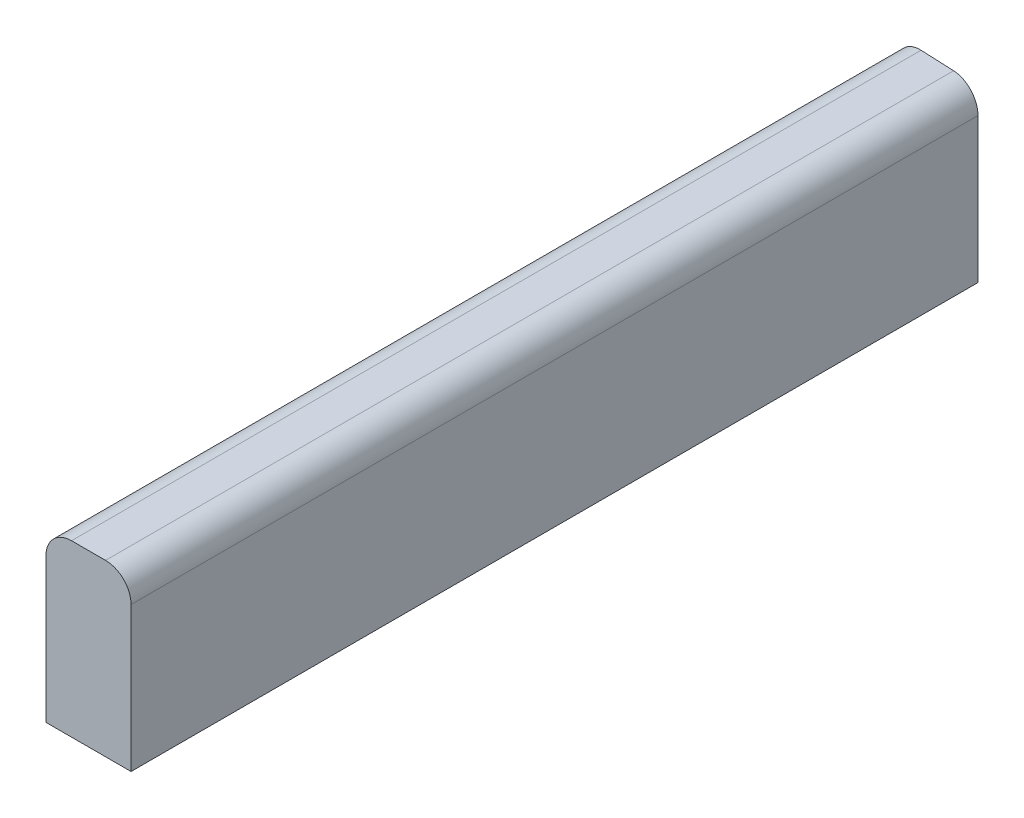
ISO-10303-21;
HEADER;
FILE_DESCRIPTION(('STEP AP214'),'2;1');
FILE_NAME('part.step','',(''),(''),'','','');
FILE_SCHEMA(('AUTOMOTIVE_DESIGN { 1 0 10303 214 1 1 1 1 }'));
ENDSEC;
DATA;
#1=APPLICATION_CONTEXT('core data for automotive mechanical design processes');
#2=APPLICATION_PROTOCOL_DEFINITION('international standard','automotive_design',2000,#1);
#3=PRODUCT_CONTEXT('',#1,'mechanical');
#4=PRODUCT('Part','Part','',(#3));
#5=PRODUCT_RELATED_PRODUCT_CATEGORY('part','',(#4));
#6=PRODUCT_DEFINITION_FORMATION('','',#4);
#7=PRODUCT_DEFINITION_CONTEXT('part definition',#1,'design');
#8=PRODUCT_DEFINITION('design','',#6,#7);
#9=PRODUCT_DEFINITION_SHAPE('','',#8);
#10=(LENGTH_UNIT() NAMED_UNIT(*) SI_UNIT(.MILLI.,.METRE.));
#11=(NAMED_UNIT(*) PLANE_ANGLE_UNIT() SI_UNIT($,.RADIAN.));
#12=(NAMED_UNIT(*) SI_UNIT($,.STERADIAN.) SOLID_ANGLE_UNIT());
#13=UNCERTAINTY_MEASURE_WITH_UNIT(LENGTH_MEASURE(1.E-05),#10,'distance_accuracy_value','');
#14=(GEOMETRIC_REPRESENTATION_CONTEXT(3) GLOBAL_UNCERTAINTY_ASSIGNED_CONTEXT((#13)) GLOBAL_UNIT_ASSIGNED_CONTEXT((#10,
#11,#12)) REPRESENTATION_CONTEXT('',''));
#15=CARTESIAN_POINT('',(0.,0.,0.));
#16=DIRECTION('',(0.,0.,1.));
#17=DIRECTION('',(1.,0.,0.));
#18=AXIS2_PLACEMENT_3D('',#15,#16,#17);
#19=CARTESIAN_POINT('',(0.,0.,100.));
#20=DIRECTION('',(1.,0.,0.));
#21=DIRECTION('',(0.,0.,-1.));
#22=AXIS2_PLACEMENT_3D('',#19,#20,#21);
#23=PLANE('',#22);
#24=DIRECTION('',(0.,-1.,0.));
#25=VECTOR('',#24,1.);
#26=CARTESIAN_POINT('',(0.,0.,0.));
#27=LINE('',#26,#25);
#28=CARTESIAN_POINT('',(0.,17.,0.));
#29=VERTEX_POINT('',#28);
#30=CARTESIAN_POINT('',(0.,0.,0.));
#31=VERTEX_POINT('',#30);
#32=EDGE_CURVE('E115',#29,#31,#27,.T.);
#33=ORIENTED_EDGE('',*,*,#32,.T.);
#34=DIRECTION('',(0.,0.,-1.));
#35=VECTOR('',#34,1.);
#36=CARTESIAN_POINT('',(0.,0.,100.));
#37=LINE('',#36,#35);
#38=CARTESIAN_POINT('',(0.,0.,100.));
#39=VERTEX_POINT('',#38);
#40=EDGE_CURVE('E11',#39,#31,#37,.T.);
#41=ORIENTED_EDGE('',*,*,#40,.F.);
#42=DIRECTION('',(0.,-1.,0.));
#43=VECTOR('',#42,1.);
#44=CARTESIAN_POINT('',(0.,0.,100.));
#45=LINE('',#44,#43);
#46=CARTESIAN_POINT('',(0.,17.,100.));
#47=VERTEX_POINT('',#46);
#48=EDGE_CURVE('E117',#47,#39,#45,.T.);
#49=ORIENTED_EDGE('',*,*,#48,.F.);
#50=DIRECTION('',(0.,0.,-1.));
#51=VECTOR('',#50,1.);
#52=CARTESIAN_POINT('',(0.,17.,100.));
#53=LINE('',#52,#51);
#54=EDGE_CURVE('E112',#47,#29,#53,.T.);
#55=ORIENTED_EDGE('',*,*,#54,.T.);
#56=EDGE_LOOP('',(#33,#41,#49,#55));
#57=FACE_BOUND('',#56,.T.);
#58=ADVANCED_FACE('F33',(#57),#23,.F.);
#59=CARTESIAN_POINT('',(0.,0.,100.));
#60=DIRECTION('',(0.,1.,0.));
#61=DIRECTION('',(0.,0.,1.));
#62=AXIS2_PLACEMENT_3D('',#59,#60,#61);
#63=PLANE('',#62);
#64=ORIENTED_EDGE('',*,*,#40,.T.);
#65=DIRECTION('',(0.999048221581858,0.,0.0436193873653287));
#66=VECTOR('',#65,1.);
#67=CARTESIAN_POINT('',(0.,0.,0.));
#68=LINE('',#67,#66);
#69=CARTESIAN_POINT('',(10.,0.,0.436609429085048));
#70=VERTEX_POINT('',#69);
#71=EDGE_CURVE('E84',#31,#70,#68,.T.);
#72=ORIENTED_EDGE('',*,*,#71,.T.);
#73=DIRECTION('',(0.,0.,-1.));
#74=VECTOR('',#73,1.);
#75=CARTESIAN_POINT('',(10.,0.,100.));
#76=LINE('',#75,#74);
#77=CARTESIAN_POINT('',(10.,0.,100.));
#78=VERTEX_POINT('',#77);
#79=EDGE_CURVE('E41',#78,#70,#76,.T.);
#80=ORIENTED_EDGE('',*,*,#79,.F.);
#81=DIRECTION('',(1.,0.,0.));
#82=VECTOR('',#81,1.);
#83=CARTESIAN_POINT('',(0.,0.,100.));
#84=LINE('',#83,#82);
#85=EDGE_CURVE('E124',#39,#78,#84,.T.);
#86=ORIENTED_EDGE('',*,*,#85,.F.);
#87=EDGE_LOOP('',(#64,#72,#80,#86));
#88=FACE_BOUND('',#87,.T.);
#89=ADVANCED_FACE('F95',(#88),#63,.F.);
#90=CARTESIAN_POINT('',(10.,0.,100.));
#91=DIRECTION('',(-1.,0.,0.));
#92=DIRECTION('',(0.,0.,1.));
#93=AXIS2_PLACEMENT_3D('',#90,#91,#92);
#94=PLANE('',#93);
#95=ORIENTED_EDGE('',*,*,#79,.T.);
#96=DIRECTION('',(0.,1.,0.));
#97=VECTOR('',#96,1.);
#98=CARTESIAN_POINT('',(10.,0.,0.436609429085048));
#99=LINE('',#98,#97);
#100=CARTESIAN_POINT('',(10.,17.,0.436609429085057));
#101=VERTEX_POINT('',#100);
#102=EDGE_CURVE('E81',#70,#101,#99,.T.);
#103=ORIENTED_EDGE('',*,*,#102,.T.);
#104=DIRECTION('',(0.,0.,-1.));
#105=VECTOR('',#104,1.);
#106=CARTESIAN_POINT('',(10.,17.,100.));
#107=LINE('',#106,#105);
#108=CARTESIAN_POINT('',(10.,17.,100.));
#109=VERTEX_POINT('',#108);
#110=EDGE_CURVE('E103',#109,#101,#107,.T.);
#111=ORIENTED_EDGE('',*,*,#110,.F.);
#112=DIRECTION('',(0.,1.,0.));
#113=VECTOR('',#112,1.);
#114=CARTESIAN_POINT('',(10.,0.,100.));
#115=LINE('',#114,#113);
#116=EDGE_CURVE('E102',#78,#109,#115,.T.);
#117=ORIENTED_EDGE('',*,*,#116,.F.);
#118=EDGE_LOOP('',(#95,#103,#111,#117));
#119=FACE_BOUND('',#118,.T.);
#120=ADVANCED_FACE('F101',(#119),#94,.F.);
#121=CARTESIAN_POINT('',(7.,17.,100.));
#122=DIRECTION('',(0.,0.,-1.));
#123=DIRECTION('',(-1.,0.,0.));
#124=AXIS2_PLACEMENT_3D('',#121,#122,#123);
#125=CYLINDRICAL_SURFACE('',#124,3.);
#126=ORIENTED_EDGE('',*,*,#110,.T.);
#127=CARTESIAN_POINT('',(7.,17.,0.305626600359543));
#128=DIRECTION('',(-0.0436193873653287,0.,0.999048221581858));
#129=DIRECTION('',(-0.999048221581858,0.,-0.0436193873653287));
#130=AXIS2_PLACEMENT_3D('',#127,#128,#129);
#131=ELLIPSE('',#130,3.00285805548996,3.);
#132=CARTESIAN_POINT('',(6.99999999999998,20.,0.305626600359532));
#133=VERTEX_POINT('',#132);
#134=EDGE_CURVE('E86',#101,#133,#131,.T.);
#135=ORIENTED_EDGE('',*,*,#134,.T.);
#136=DIRECTION('',(0.,0.,-1.));
#137=VECTOR('',#136,1.);
#138=CARTESIAN_POINT('',(6.99999999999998,20.,100.));
#139=LINE('',#138,#137);
#140=CARTESIAN_POINT('',(6.99999999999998,20.,100.));
#141=VERTEX_POINT('',#140);
#142=EDGE_CURVE('E104',#141,#133,#139,.T.);
#143=ORIENTED_EDGE('',*,*,#142,.F.);
#144=CARTESIAN_POINT('',(7.,17.,100.));
#145=DIRECTION('',(0.,0.,1.));
#146=DIRECTION('',(1.,0.,0.));
#147=AXIS2_PLACEMENT_3D('',#144,#145,#146);
#148=CIRCLE('',#147,3.);
#149=EDGE_CURVE('E121',#109,#141,#148,.T.);
#150=ORIENTED_EDGE('',*,*,#149,.F.);
#151=EDGE_LOOP('',(#126,#135,#143,#150));
#152=FACE_BOUND('',#151,.T.);
#153=ADVANCED_FACE('F135',(#152),#125,.T.);
#154=CARTESIAN_POINT('',(3.00000000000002,20.,100.));
#155=DIRECTION('',(0.,-1.,0.));
#156=DIRECTION('',(0.,0.,-1.));
#157=AXIS2_PLACEMENT_3D('',#154,#155,#156);
#158=PLANE('',#157);
#159=ORIENTED_EDGE('',*,*,#142,.T.);
#160=DIRECTION('',(0.999048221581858,0.,0.0436193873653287));
#161=VECTOR('',#160,1.);
#162=CARTESIAN_POINT('',(0.,20.,0.));
#163=LINE('',#162,#161);
#164=CARTESIAN_POINT('',(3.,20.,0.130982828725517));
#165=VERTEX_POINT('',#164);
#166=EDGE_CURVE('E99',#165,#133,#163,.T.);
#167=ORIENTED_EDGE('',*,*,#166,.F.);
#168=DIRECTION('',(0.,0.,-1.));
#169=VECTOR('',#168,1.);
#170=CARTESIAN_POINT('',(3.00000000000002,20.,100.));
#171=LINE('',#170,#169);
#172=CARTESIAN_POINT('',(3.00000000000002,20.,100.));
#173=VERTEX_POINT('',#172);
#174=EDGE_CURVE('E109',#173,#165,#171,.T.);
#175=ORIENTED_EDGE('',*,*,#174,.F.);
#176=DIRECTION('',(-1.,0.,0.));
#177=VECTOR('',#176,1.);
#178=CARTESIAN_POINT('',(3.00000000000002,20.,100.));
#179=LINE('',#178,#177);
#180=EDGE_CURVE('E119',#141,#173,#179,.T.);
#181=ORIENTED_EDGE('',*,*,#180,.F.);
#182=EDGE_LOOP('',(#159,#167,#175,#181));
#183=FACE_BOUND('',#182,.T.);
#184=ADVANCED_FACE('F138',(#183),#158,.F.);
#185=CARTESIAN_POINT('',(3.,17.,100.));
#186=DIRECTION('',(0.,0.,-1.));
#187=DIRECTION('',(-1.,0.,0.));
#188=AXIS2_PLACEMENT_3D('',#185,#186,#187);
#189=CYLINDRICAL_SURFACE('',#188,3.);
#190=ORIENTED_EDGE('',*,*,#174,.T.);
#191=CARTESIAN_POINT('',(3.,17.,0.13098282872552));
#192=DIRECTION('',(-0.0436193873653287,0.,0.999048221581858));
#193=DIRECTION('',(-0.999048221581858,0.,-0.0436193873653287));
#194=AXIS2_PLACEMENT_3D('',#191,#192,#193);
#195=ELLIPSE('',#194,3.00285805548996,3.);
#196=EDGE_CURVE('E91',#165,#29,#195,.T.);
#197=ORIENTED_EDGE('',*,*,#196,.T.);
#198=ORIENTED_EDGE('',*,*,#54,.F.);
#199=CARTESIAN_POINT('',(3.,17.,100.));
#200=DIRECTION('',(0.,0.,1.));
#201=DIRECTION('',(-1.,0.,0.));
#202=AXIS2_PLACEMENT_3D('',#199,#200,#201);
#203=CIRCLE('',#202,3.);
#204=EDGE_CURVE('E48',#173,#47,#203,.T.);
#205=ORIENTED_EDGE('',*,*,#204,.F.);
#206=EDGE_LOOP('',(#190,#197,#198,#205));
#207=FACE_BOUND('',#206,.T.);
#208=ADVANCED_FACE('F143',(#207),#189,.T.);
#209=CARTESIAN_POINT('',(3.,17.,100.));
#210=DIRECTION('',(0.,0.,-1.));
#211=DIRECTION('',(-1.,0.,0.));
#212=AXIS2_PLACEMENT_3D('',#209,#210,#211);
#213=PLANE('',#212);
#214=ORIENTED_EDGE('',*,*,#48,.T.);
#215=ORIENTED_EDGE('',*,*,#85,.T.);
#216=ORIENTED_EDGE('',*,*,#116,.T.);
#217=ORIENTED_EDGE('',*,*,#149,.T.);
#218=ORIENTED_EDGE('',*,*,#180,.T.);
#219=ORIENTED_EDGE('',*,*,#204,.T.);
#220=EDGE_LOOP('',(#214,#215,#216,#217,#218,#219));
#221=FACE_BOUND('',#220,.T.);
#222=ADVANCED_FACE('F139',(#221),#213,.F.);
#223=CARTESIAN_POINT('',(0.,0.,0.));
#224=DIRECTION('',(-0.0436193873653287,0.,0.999048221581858));
#225=DIRECTION('',(0.999048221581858,0.,0.0436193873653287));
#226=AXIS2_PLACEMENT_3D('',#223,#224,#225);
#227=PLANE('',#226);
#228=ORIENTED_EDGE('',*,*,#102,.F.);
#229=ORIENTED_EDGE('',*,*,#71,.F.);
#230=ORIENTED_EDGE('',*,*,#32,.F.);
#231=ORIENTED_EDGE('',*,*,#196,.F.);
#232=ORIENTED_EDGE('',*,*,#166,.T.);
#233=ORIENTED_EDGE('',*,*,#134,.F.);
#234=EDGE_LOOP('',(#228,#229,#230,#231,#232,#233));
#235=FACE_BOUND('',#234,.T.);
#236=ADVANCED_FACE('F83',(#235),#227,.F.);
#237=CLOSED_SHELL('',(#58,#89,#120,#153,#184,#208,#222,#236));
#238=MANIFOLD_SOLID_BREP('B2',#237);
#239=ADVANCED_BREP_SHAPE_REPRESENTATION('',(#18,#238),#14);
#240=SHAPE_DEFINITION_REPRESENTATION(#9,#239);
ENDSEC;
END-ISO-10303-21;
